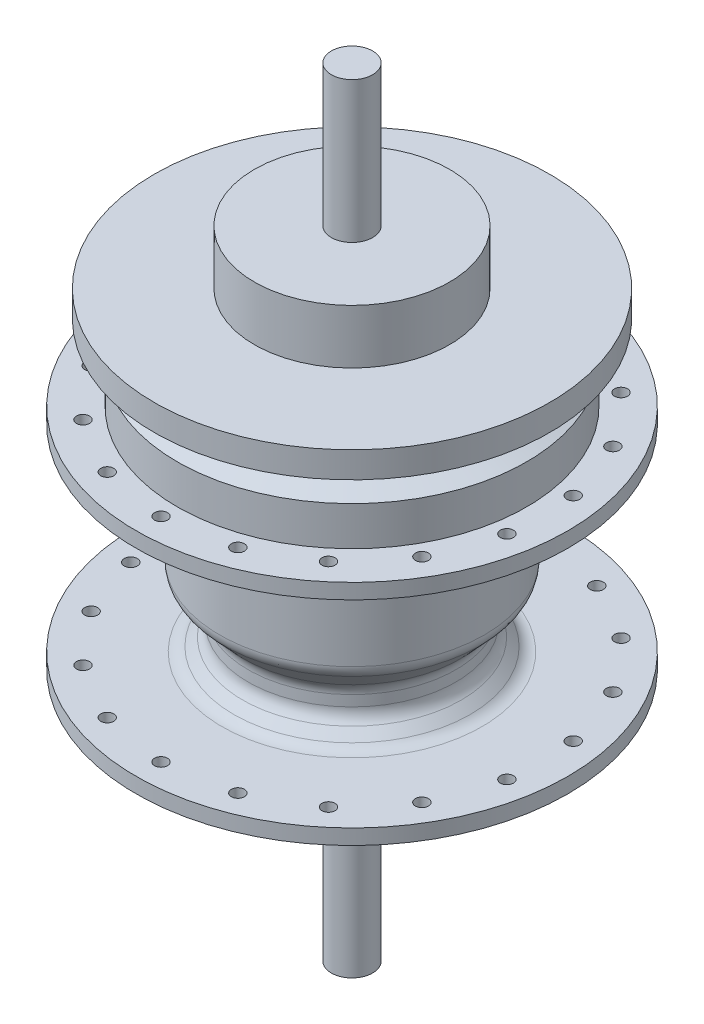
from build123d import *

# Parameters (mm, degrees)
SKETCH2_R          = 1.5
CUT_EXTRUDE1_DEPTH = 60
CIRPATTERN1_COUNT  = 18
FILLET1_R          = 4


with BuildPart() as part:
    # Sketch1 → Revolve1 (revolve)
    with BuildSketch(Plane.XY):
        Polygon((0, 84.6375), (-4.75, 84.6375), (-4.75, 52.1375), (-22.5, 52.1375), (-22.5, 39.6375), (-45.565, 39.6375), (-45.565, 33.6375), (-22.5, 33.6375), (-31, 30.8375), (-31, 28.6375), (-40.25, 25.1375), (-40.25, 16.1375), (-49.75, 16.1375), (-49.75, 12.6375), (-39.75, 12.6375), (-30.4875, 2.6375), (-30.4875, -15.8625), (-23.916993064, -22.956164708), (-23.916993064, -28.729439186), (-28.379136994, -32.8625), (-49.75, -32.8625), (-49.75, -36.3625), (-32, -36.3625), (-30.517647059, -40.8625), (-17.7, -40.8625), (-17.7, -47.3625), (-7.6, -47.3625), (-7.6, -59.6125), (-4.75, -59.6125), (-4.75, -94.6125), (0, -94.6125), align=None)
    revolve(axis=Axis((0, 84.6375, 0), (0, -1, 0)))

    # Sketch2 → Cut-Extrude1 (cut)
    with BuildSketch(Plane.XZ.offset(36.3625)):
        with Locations((0, 44)):
            Circle(SKETCH2_R)
    cut_extrude1 = extrude(amount=-CUT_EXTRUDE1_DEPTH, mode=Mode.SUBTRACT)

    # CirPattern1: Cut-Extrude1 ×18 about axis
    cirpattern1_axis = Axis((0, 0, 0), (0, 1, 0))
    for i in range(1, CIRPATTERN1_COUNT):
        add(cut_extrude1.rotate(cirpattern1_axis, i * 360 / CIRPATTERN1_COUNT), mode=Mode.SUBTRACT)

    # Fillet1
    fillet1_edges = [part.edges().sort_by_distance(p)[0] for p in [
        (28.379136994, -32.8625, 0),
        (23.916993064, -28.729439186, 0),
        (23.916993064, -22.956164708, 0),
        (30.4875, -15.8625, 0),
        (30.4875, 2.6375, 0),
        (39.75, 12.6375, 0),
    ]]
    fillet(fillet1_edges, radius=FILLET1_R)


solid = part.part
